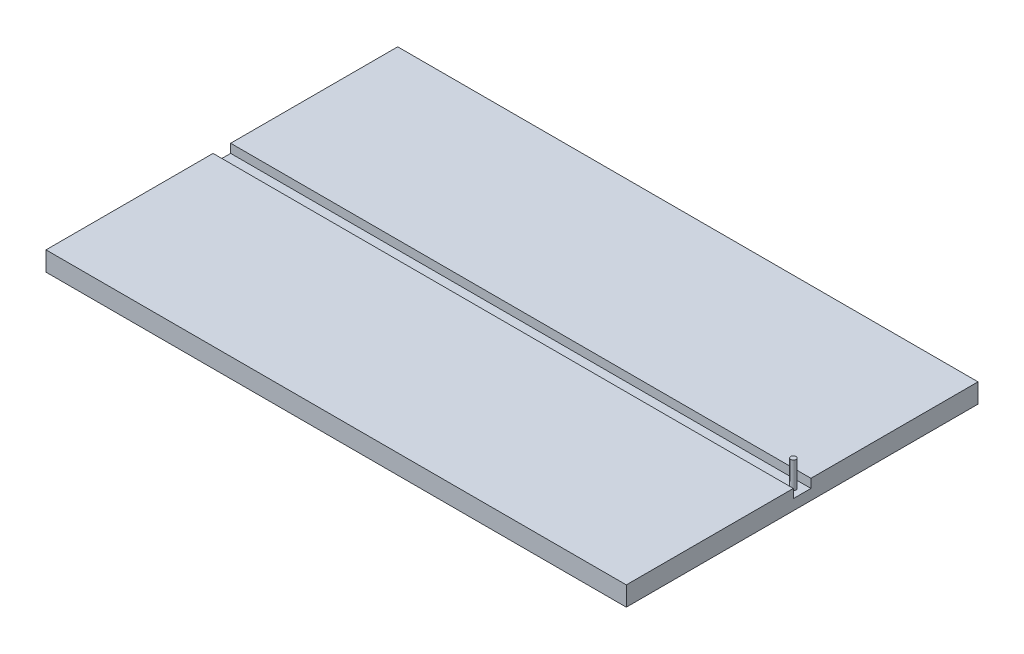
from build123d import *

# Parameters (mm, degrees)
SKETCH1_W           = 330
SKETCH1_H           = 200
BOSS_EXTRUDE1_DEPTH = 6
SKETCH2_W           = 330
SKETCH2_H           = 95
BOSS_EXTRUDE2_DEPTH = 5
SKETCH3_R           = 1.5
BOSS_EXTRUDE3_DEPTH = 15


with BuildPart() as part:
    # Sketch1 → Boss-Extrude1 (new body)
    with BuildSketch(Plane(origin=(0, 0, 0), x_dir=(1, 0, 0), z_dir=(0, 1, 0))):
        with Locations((165, 100)):
            Rectangle(SKETCH1_W, SKETCH1_H)
    extrude(amount=BOSS_EXTRUDE1_DEPTH)

    # Sketch2 → Boss-Extrude2 (add)
    with BuildSketch(Plane(origin=(0, 6, 0), x_dir=(1, 0, 0), z_dir=(0, 1, 0))):
        with Locations((165, 47.5)):
            Rectangle(SKETCH2_W, SKETCH2_H)
        with Locations((165, 152.5)):
            Rectangle(SKETCH2_W, SKETCH2_H)
    extrude(amount=BOSS_EXTRUDE2_DEPTH)

    # Sketch3 → Boss-Extrude3 (add)
    with BuildSketch(Plane(origin=(0, 6, 0), x_dir=(1, 0, 0), z_dir=(0, 1, 0))):
        with Locations(Location((325, 100, 0), (0, 0, 90))):
            Circle(SKETCH3_R)
    extrude(amount=BOSS_EXTRUDE3_DEPTH)


solid = part.part
